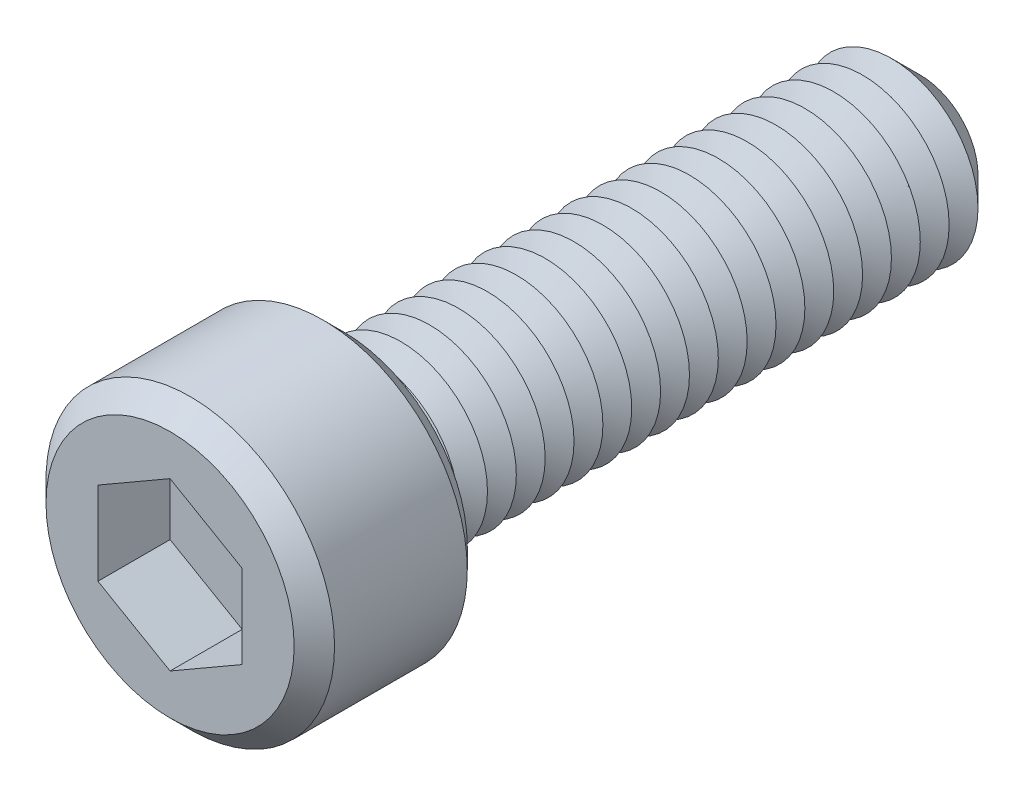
from build123d import *

# Parameters (mm, degrees)
SKETCH1_R           = 5
BOSS_EXTRUDE1_DEPTH = 6
SKETCH2_R           = 3
BOSS_EXTRUDE2_DEPTH = 20
CHAMFER1_SIZE       = 1
LPATTERN1_COUNT     = 19
LPATTERN1_PITCH     = 1
CUT_EXTRUDE1_DEPTH  = 2.5
SKETCH6_R           = 0.8
CUT_EXTRUDE2_DEPTH  = 23.5
CHAMFER2_SIZE       = 0.7


with BuildPart() as part:
    # Sketch1 → Boss-Extrude1 (new body)
    with BuildSketch(Plane.XY):
        Circle(SKETCH1_R)
    extrude(amount=BOSS_EXTRUDE1_DEPTH)

    # Sketch2 → Boss-Extrude2 (add)
    with BuildSketch(Plane(origin=(0, 0, 0), x_dir=(-1, 0, 0), z_dir=(0, 0, -1))):
        Circle(SKETCH2_R)
    extrude(amount=BOSS_EXTRUDE2_DEPTH)

    # Chamfer1
    chamfer1_edges = [part.edges().sort_by_distance(p)[0] for p in [
        (3, 0, -20),
    ]]
    chamfer(chamfer1_edges, length=CHAMFER1_SIZE)

    # Sketch4 → Cut-Revolve1 (revolve, cut)
    with BuildSketch(Plane(origin=(0, 0, 0), x_dir=(0, 0, -1), z_dir=(1, 0, 0)), mode=Mode.PRIVATE) as cut_revolve1_sk:
        Polygon((0, 3), (0.5, 2.133974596), (1, 3), align=None)
    cut_revolve1 = revolve(cut_revolve1_sk.sketch.rotate(Axis((0, 0, 2.512122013), (0, 0, -1)), 90), axis=Axis((0, 0, 2.512122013), (0, 0, -1)), mode=Mode.SUBTRACT)

    # LPattern1: Cut-Revolve1 ×19
    with Locations(*[(0, 0, -i * LPATTERN1_PITCH) for i in range(1, LPATTERN1_COUNT)]):
        add(cut_revolve1, mode=Mode.SUBTRACT)

    # Sketch5 → Cut-Extrude1 (cut)
    with BuildSketch(Plane.XY.offset(6)):
        Polygon((0, 2.886751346), (-2.5, 1.443375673), (-2.5, -1.443375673), (0, -2.886751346), (2.5, -1.443375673), (2.5, 1.443375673), align=None)
    extrude(amount=-CUT_EXTRUDE1_DEPTH, mode=Mode.SUBTRACT)

    # Sketch6 → Cut-Extrude2 (cut)
    with BuildSketch(Plane.XY.offset(3.5)):
        Circle(SKETCH6_R)
    extrude(amount=-CUT_EXTRUDE2_DEPTH, mode=Mode.SUBTRACT)

    # Chamfer2
    chamfer2_edges = [part.edges().sort_by_distance(p)[0] for p in [
        (-5, 0, 0),
        (-5, 0, 6),
    ]]
    chamfer(chamfer2_edges, length=CHAMFER2_SIZE)


solid = part.part
